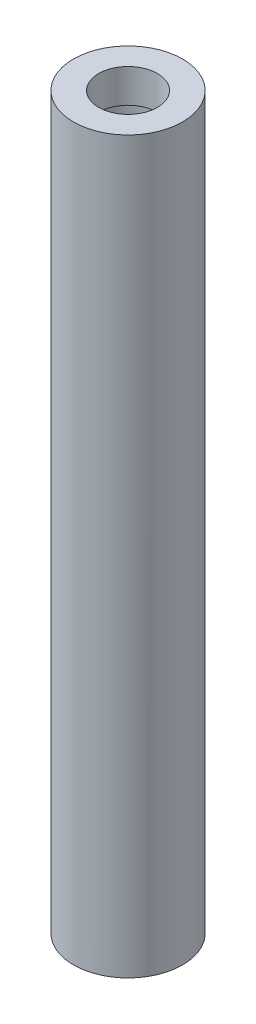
from build123d import *

# Parameters (mm, degrees)
SKETCH1_R           = 3.25
BOSS_EXTRUDE1_DEPTH = 39.5
SKETCH3_R           = 2.25
CUT_EXTRUDE1_DEPTH  = 53
BOSS_EXTRUDE2_START = 2
SKETCH4_R           = 3.25
SKETCH4_R_2         = 1.75
BOSS_EXTRUDE2_DEPTH = 2
SKETCH5_R           = 3.25
SKETCH5_R_2         = 1.75
BOSS_EXTRUDE3_DEPTH = 2


with BuildPart() as part:
    # Sketch1 → Boss-Extrude1 (new body)
    with BuildSketch(Plane(origin=(0, 0, 0), x_dir=(1, 0, 0), z_dir=(0, 1, 0))):
        with Locations(Location((0, 0, 0), (0, 0, 270))):
            Circle(SKETCH1_R)
    extrude(amount=BOSS_EXTRUDE1_DEPTH)

    # Sketch3 → Cut-Extrude1 (cut)
    with BuildSketch(Plane(origin=(0, 39.5, 0), x_dir=(1, 0, 0), z_dir=(0, 1, 0))):
        with Locations(Location((0, 0, 0), (0, 0, 270))):
            Circle(SKETCH3_R)
    extrude(amount=-CUT_EXTRUDE1_DEPTH, mode=Mode.SUBTRACT)

    # Sketch4 → Boss-Extrude2 (add)
    with BuildSketch(Plane.XZ.offset(BOSS_EXTRUDE2_START)):
        with Locations(Location((0, 0, 0), (0, 0, 270))):
            Circle(SKETCH4_R)
        with Locations(Location((0, 0, 0), (0, 0, 270))):
            Circle(SKETCH4_R_2, mode=Mode.SUBTRACT)
    extrude(amount=-BOSS_EXTRUDE2_DEPTH)

    # Sketch5 → Boss-Extrude3 (add)
    with BuildSketch(Plane(origin=(0, 39.5, 0), x_dir=(1, 0, 0), z_dir=(0, 1, 0))):
        with Locations(Location((0, 0, 0), (0, 0, 90))):
            Circle(SKETCH5_R)
        with Locations(Location((0, 0, 0), (0, 0, 90))):
            Circle(SKETCH5_R_2, mode=Mode.SUBTRACT)
    extrude(amount=BOSS_EXTRUDE3_DEPTH)


solid = part.part
